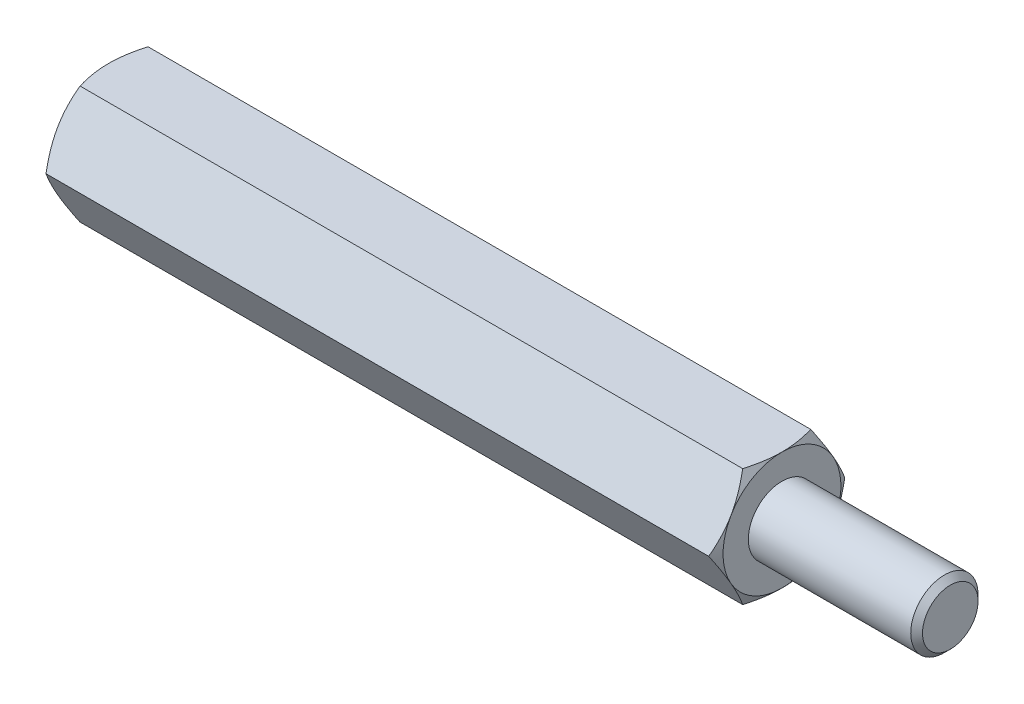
ISO-10303-21;
HEADER;
FILE_DESCRIPTION(('STEP AP214'),'2;1');
FILE_NAME('part.step','',(''),(''),'','','');
FILE_SCHEMA(('AUTOMOTIVE_DESIGN { 1 0 10303 214 1 1 1 1 }'));
ENDSEC;
DATA;
#1=APPLICATION_CONTEXT('core data for automotive mechanical design processes');
#2=APPLICATION_PROTOCOL_DEFINITION('international standard','automotive_design',2000,#1);
#3=PRODUCT_CONTEXT('',#1,'mechanical');
#4=PRODUCT('Part','Part','',(#3));
#5=PRODUCT_RELATED_PRODUCT_CATEGORY('part','',(#4));
#6=PRODUCT_DEFINITION_FORMATION('','',#4);
#7=PRODUCT_DEFINITION_CONTEXT('part definition',#1,'design');
#8=PRODUCT_DEFINITION('design','',#6,#7);
#9=PRODUCT_DEFINITION_SHAPE('','',#8);
#10=(LENGTH_UNIT() NAMED_UNIT(*) SI_UNIT(.MILLI.,.METRE.));
#11=(NAMED_UNIT(*) PLANE_ANGLE_UNIT() SI_UNIT($,.RADIAN.));
#12=(NAMED_UNIT(*) SI_UNIT($,.STERADIAN.) SOLID_ANGLE_UNIT());
#13=UNCERTAINTY_MEASURE_WITH_UNIT(LENGTH_MEASURE(1.E-05),#10,'distance_accuracy_value','');
#14=(GEOMETRIC_REPRESENTATION_CONTEXT(3) GLOBAL_UNCERTAINTY_ASSIGNED_CONTEXT((#13)) GLOBAL_UNIT_ASSIGNED_CONTEXT((#10,
#11,#12)) REPRESENTATION_CONTEXT('',''));
#15=CARTESIAN_POINT('',(0.,0.,0.));
#16=DIRECTION('',(0.,0.,1.));
#17=DIRECTION('',(1.,0.,0.));
#18=AXIS2_PLACEMENT_3D('',#15,#16,#17);
#19=CARTESIAN_POINT('',(20.,3.5,-2.02072594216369));
#20=DIRECTION('',(1.,0.,0.));
#21=DIRECTION('',(0.,0.,-1.));
#22=AXIS2_PLACEMENT_3D('',#19,#20,#21);
#23=PLANE('',#22);
#24=CARTESIAN_POINT('',(20.,0.,0.));
#25=DIRECTION('',(1.,0.,0.));
#26=DIRECTION('',(0.,0.,-1.));
#27=AXIS2_PLACEMENT_3D('',#24,#25,#26);
#28=CIRCLE('',#27,3.5);
#29=CARTESIAN_POINT('',(20.,-1.75,-3.03108891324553));
#30=VERTEX_POINT('',#29);
#31=CARTESIAN_POINT('',(20.,1.75,-3.03108891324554));
#32=VERTEX_POINT('',#31);
#33=EDGE_CURVE('E288',#30,#32,#28,.T.);
#34=ORIENTED_EDGE('',*,*,#33,.T.);
#35=CARTESIAN_POINT('',(20.,3.5,0.));
#36=VERTEX_POINT('',#35);
#37=EDGE_CURVE('E53',#32,#36,#28,.T.);
#38=ORIENTED_EDGE('',*,*,#37,.T.);
#39=CARTESIAN_POINT('',(20.,1.75,3.03108891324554));
#40=VERTEX_POINT('',#39);
#41=EDGE_CURVE('E297',#36,#40,#28,.T.);
#42=ORIENTED_EDGE('',*,*,#41,.T.);
#43=CARTESIAN_POINT('',(20.,-1.75000000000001,3.03108891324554));
#44=VERTEX_POINT('',#43);
#45=EDGE_CURVE('E303',#40,#44,#28,.T.);
#46=ORIENTED_EDGE('',*,*,#45,.T.);
#47=CARTESIAN_POINT('',(20.,0.,0.));
#48=DIRECTION('',(-1.,0.,0.));
#49=DIRECTION('',(0.,-1.,0.));
#50=AXIS2_PLACEMENT_3D('',#47,#48,#49);
#51=CIRCLE('',#50,3.5);
#52=CARTESIAN_POINT('',(20.,-3.50000000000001,0.));
#53=VERTEX_POINT('',#52);
#54=EDGE_CURVE('E193',#53,#44,#51,.T.);
#55=ORIENTED_EDGE('',*,*,#54,.F.);
#56=EDGE_CURVE('E61',#53,#30,#28,.T.);
#57=ORIENTED_EDGE('',*,*,#56,.T.);
#58=EDGE_LOOP('',(#34,#38,#42,#46,#55,#57));
#59=FACE_BOUND('',#58,.T.);
#60=CARTESIAN_POINT('',(20.,0.,0.));
#61=DIRECTION('',(1.,0.,0.));
#62=DIRECTION('',(0.,0.,-1.));
#63=AXIS2_PLACEMENT_3D('',#60,#61,#62);
#64=CIRCLE('',#63,2.);
#65=CARTESIAN_POINT('',(20.,0.,-2.));
#66=VERTEX_POINT('',#65);
#67=EDGE_CURVE('E326',#66,#66,#64,.T.);
#68=ORIENTED_EDGE('',*,*,#67,.F.);
#69=EDGE_LOOP('',(#68));
#70=FACE_BOUND('',#69,.T.);
#71=ADVANCED_FACE('F37',(#59,#70),#23,.T.);
#72=CARTESIAN_POINT('',(20.,0.,-4.04145188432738));
#73=DIRECTION('',(0.,-0.5,0.866025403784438));
#74=DIRECTION('',(0.,-0.866025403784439,-0.5));
#75=AXIS2_PLACEMENT_3D('',#72,#73,#74);
#76=PLANE('',#75);
#77=CARTESIAN_POINT('',(19.6873259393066,-0.000200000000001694,-4.04156735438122));
#78=CARTESIAN_POINT('',(19.73861421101,0.153607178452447,-3.9527667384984));
#79=CARTESIAN_POINT('',(19.7852590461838,0.308742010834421,-3.86319960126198));
#80=CARTESIAN_POINT('',(19.8666781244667,0.621698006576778,-3.68251437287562));
#81=CARTESIAN_POINT('',(19.9014235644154,0.779524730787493,-3.59139307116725));
#82=CARTESIAN_POINT('',(19.9555099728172,1.09322221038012,-3.41027974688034));
#83=CARTESIAN_POINT('',(19.9752109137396,1.24904469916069,-3.32031559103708));
#84=CARTESIAN_POINT('',(19.9987298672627,1.56142288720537,-3.13996396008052));
#85=CARTESIAN_POINT('',(20.0025673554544,1.71797745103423,-3.04957714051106));
#86=CARTESIAN_POINT('',(19.994584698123,2.01050921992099,-2.88068384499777));
#87=CARTESIAN_POINT('',(19.9847245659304,2.1465302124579,-2.80215208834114));
#88=CARTESIAN_POINT('',(19.9534735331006,2.41768602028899,-2.64560020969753));
#89=CARTESIAN_POINT('',(19.9320719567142,2.55281989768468,-2.5675806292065));
#90=CARTESIAN_POINT('',(19.8785695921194,2.82453479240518,-2.41070596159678));
#91=CARTESIAN_POINT('',(19.8462420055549,2.96108141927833,-2.33187072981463));
#92=CARTESIAN_POINT('',(19.772871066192,3.2321380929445,-2.17537608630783));
#93=CARTESIAN_POINT('',(19.7318449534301,3.36665161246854,-2.09771466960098));
#94=CARTESIAN_POINT('',(19.6873259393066,3.5002,-2.02061047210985));
#95=B_SPLINE_CURVE_WITH_KNOTS('',3,(#77,#78,#79,#80,#81,#82,#83,#84,#85,#86,#87,#88,#89,#90,#91,
#92,#93,#94),.UNSPECIFIED.,.F.,.F.,(4,2,2,2,2,2,2,2,4),(0.,0.554793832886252,1.11092123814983,
1.65328467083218,2.19498204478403,2.6666513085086,3.13875761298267,3.6213361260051,
4.10296698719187),.UNSPECIFIED.);
#96=CARTESIAN_POINT('',(19.6873926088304,0.,-4.04145188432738));
#97=VERTEX_POINT('',#96);
#98=EDGE_CURVE('E333',#97,#32,#95,.T.);
#99=ORIENTED_EDGE('',*,*,#98,.F.);
#100=DIRECTION('',(-1.,0.,0.));
#101=VECTOR('',#100,1.);
#102=CARTESIAN_POINT('',(20.,0.,-4.04145188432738));
#103=LINE('',#102,#101);
#104=CARTESIAN_POINT('',(-19.6873926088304,0.,-4.04145188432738));
#105=VERTEX_POINT('',#104);
#106=EDGE_CURVE('E264',#97,#105,#103,.T.);
#107=ORIENTED_EDGE('',*,*,#106,.T.);
#108=CARTESIAN_POINT('',(-19.6873259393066,3.5002,-2.02061047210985));
#109=CARTESIAN_POINT('',(-19.73861421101,3.34639282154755,-2.10941108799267));
#110=CARTESIAN_POINT('',(-19.7852590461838,3.19125798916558,-2.19897822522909));
#111=CARTESIAN_POINT('',(-19.8666781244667,2.87830199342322,-2.37966345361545));
#112=CARTESIAN_POINT('',(-19.9014235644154,2.7204752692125,-2.47078475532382));
#113=CARTESIAN_POINT('',(-19.9555099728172,2.40677778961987,-2.65189807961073));
#114=CARTESIAN_POINT('',(-19.9752109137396,2.25095530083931,-2.74186223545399));
#115=CARTESIAN_POINT('',(-19.9987298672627,1.93857711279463,-2.92221386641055));
#116=CARTESIAN_POINT('',(-20.0025673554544,1.78202254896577,-3.01260068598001));
#117=CARTESIAN_POINT('',(-19.994584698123,1.48949078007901,-3.1814939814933));
#118=CARTESIAN_POINT('',(-19.9847245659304,1.35346978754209,-3.26002573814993));
#119=CARTESIAN_POINT('',(-19.9534735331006,1.08231397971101,-3.41657761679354));
#120=CARTESIAN_POINT('',(-19.9320719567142,0.947180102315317,-3.49459719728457));
#121=CARTESIAN_POINT('',(-19.8785695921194,0.675465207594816,-3.65147186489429));
#122=CARTESIAN_POINT('',(-19.8462420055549,0.538918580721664,-3.73030709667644));
#123=CARTESIAN_POINT('',(-19.772871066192,0.267861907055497,-3.88680174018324));
#124=CARTESIAN_POINT('',(-19.7318449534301,0.133348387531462,-3.96446315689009));
#125=CARTESIAN_POINT('',(-19.6873259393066,-0.000200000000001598,-4.04156735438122));
#126=B_SPLINE_CURVE_WITH_KNOTS('',3,(#108,#109,#110,#111,#112,#113,#114,#115,#116,#117,#118,
#119,#120,#121,#122,#123,#124,#125),.UNSPECIFIED.,.F.,.F.,(4,2,2,2,2,2,2,2,4),(0.,
0.554793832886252,1.11092123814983,1.65328467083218,2.19498204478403,2.6666513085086,
3.13875761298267,3.6213361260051,4.10296698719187),.UNSPECIFIED.);
#127=CARTESIAN_POINT('',(-20.,1.75,-3.03108891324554));
#128=VERTEX_POINT('',#127);
#129=EDGE_CURVE('E314',#128,#105,#126,.T.);
#130=ORIENTED_EDGE('',*,*,#129,.F.);
#131=CARTESIAN_POINT('',(-19.6873926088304,3.5,-2.02072594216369));
#132=VERTEX_POINT('',#131);
#133=EDGE_CURVE('E374',#132,#128,#126,.T.);
#134=ORIENTED_EDGE('',*,*,#133,.F.);
#135=DIRECTION('',(-1.,0.,0.));
#136=VECTOR('',#135,1.);
#137=CARTESIAN_POINT('',(20.,3.5,-2.02072594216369));
#138=LINE('',#137,#136);
#139=CARTESIAN_POINT('',(19.6873926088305,3.5,-2.02072594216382));
#140=VERTEX_POINT('',#139);
#141=EDGE_CURVE('E279',#140,#132,#138,.T.);
#142=ORIENTED_EDGE('',*,*,#141,.F.);
#143=EDGE_CURVE('E229',#32,#140,#95,.T.);
#144=ORIENTED_EDGE('',*,*,#143,.F.);
#145=EDGE_LOOP('',(#99,#107,#130,#134,#142,#144));
#146=FACE_BOUND('',#145,.T.);
#147=ADVANCED_FACE('F148',(#146),#76,.F.);
#148=CARTESIAN_POINT('',(20.,3.5,-2.02072594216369));
#149=DIRECTION('',(0.,-1.,0.));
#150=DIRECTION('',(0.,0.,-1.));
#151=AXIS2_PLACEMENT_3D('',#148,#149,#150);
#152=PLANE('',#151);
#153=CARTESIAN_POINT('',(18.2443294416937,3.5,-5.525713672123));
#154=CARTESIAN_POINT('',(18.3192813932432,3.5,-5.37200190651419));
#155=CARTESIAN_POINT('',(18.3935424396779,3.5,-5.21794762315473));
#156=CARTESIAN_POINT('',(18.5402960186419,3.5,-4.90897223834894));
#157=CARTESIAN_POINT('',(18.6127882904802,3.5,-4.75405101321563));
#158=CARTESIAN_POINT('',(18.7559617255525,3.5,-4.44240758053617));
#159=CARTESIAN_POINT('',(18.8266316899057,3.5,-4.28568021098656));
#160=CARTESIAN_POINT('',(18.9652074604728,3.5,-3.97101270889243));
#161=CARTESIAN_POINT('',(19.0331133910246,3.5,-3.81307263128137));
#162=CARTESIAN_POINT('',(19.1677143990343,3.5,-3.49026114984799));
#163=CARTESIAN_POINT('',(19.2342871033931,3.5,-3.32533845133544));
#164=CARTESIAN_POINT('',(19.3626267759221,3.5,-2.99359992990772));
#165=CARTESIAN_POINT('',(19.4243932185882,3.5,-2.82678390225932));
#166=CARTESIAN_POINT('',(19.5415700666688,3.5,-2.49127529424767));
#167=CARTESIAN_POINT('',(19.5969925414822,3.5,-2.32258697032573));
#168=CARTESIAN_POINT('',(19.6997679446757,3.5,-1.98279215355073));
#169=CARTESIAN_POINT('',(19.7471233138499,3.5,-1.81168640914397));
#170=CARTESIAN_POINT('',(19.8312987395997,3.5,-1.46793354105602));
#171=CARTESIAN_POINT('',(19.8681796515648,3.5,-1.2953015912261));
#172=CARTESIAN_POINT('',(19.9293955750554,3.5,-0.947791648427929));
#173=CARTESIAN_POINT('',(19.953731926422,3.5,-0.772913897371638));
#174=CARTESIAN_POINT('',(19.9876038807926,3.5,-0.424108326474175));
#175=CARTESIAN_POINT('',(19.997337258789,3.5,-0.250200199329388));
#176=CARTESIAN_POINT('',(20.0017053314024,3.5,0.0978233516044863));
#177=CARTESIAN_POINT('',(19.9963399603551,3.5,0.271938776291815));
#178=CARTESIAN_POINT('',(19.9750118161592,3.5,0.564711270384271));
#179=CARTESIAN_POINT('',(19.9628919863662,3.5,0.683667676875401));
#180=CARTESIAN_POINT('',(19.9323080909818,3.5,0.920767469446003));
#181=CARTESIAN_POINT('',(19.9138432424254,3.5,1.03891075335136));
#182=CARTESIAN_POINT('',(19.8498956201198,3.5,1.39193174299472));
#183=CARTESIAN_POINT('',(19.7958695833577,3.5,1.62528232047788));
#184=CARTESIAN_POINT('',(19.7014515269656,3.5,1.97433825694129));
#185=CARTESIAN_POINT('',(19.6672900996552,3.5,2.09183268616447));
#186=CARTESIAN_POINT('',(19.595234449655,3.5,2.32568238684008));
#187=CARTESIAN_POINT('',(19.5573401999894,3.5,2.44203765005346));
#188=CARTESIAN_POINT('',(19.4784421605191,3.5,2.6736423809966));
#189=CARTESIAN_POINT('',(19.4374392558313,3.5,2.78889215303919));
#190=CARTESIAN_POINT('',(19.352824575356,3.5,3.01842460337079));
#191=CARTESIAN_POINT('',(19.3092128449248,3.5,3.1327072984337));
#192=CARTESIAN_POINT('',(19.1958241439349,3.5,3.42150510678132));
#193=CARTESIAN_POINT('',(19.1245636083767,3.5,3.59543696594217));
#194=CARTESIAN_POINT('',(18.9781026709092,3.5,3.94163961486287));
#195=CARTESIAN_POINT('',(18.9029019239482,3.5,4.11391025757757));
#196=CARTESIAN_POINT('',(18.7494252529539,3.5,4.45713072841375));
#197=CARTESIAN_POINT('',(18.6711484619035,3.5,4.62808016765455));
#198=CARTESIAN_POINT('',(18.512188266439,3.5,4.9688584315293));
#199=CARTESIAN_POINT('',(18.4315047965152,3.5,5.13868722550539));
#200=CARTESIAN_POINT('',(18.1863871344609,3.5,5.64726192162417));
#201=CARTESIAN_POINT('',(18.0190975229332,3.5,5.98463020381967));
#202=CARTESIAN_POINT('',(17.6795854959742,3.5,6.65678495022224));
#203=CARTESIAN_POINT('',(17.5073639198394,3.5,6.99157184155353));
#204=CARTESIAN_POINT('',(17.1760800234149,3.5,7.62749570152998));
#205=CARTESIAN_POINT('',(17.0173299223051,3.5,7.92879562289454));
#206=CARTESIAN_POINT('',(16.6977473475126,3.5,8.53030635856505));
#207=CARTESIAN_POINT('',(16.5369147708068,3.5,8.83051711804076));
#208=CARTESIAN_POINT('',(16.2141792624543,3.5,9.42918006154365));
#209=CARTESIAN_POINT('',(16.0522810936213,3.5,9.72763481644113));
#210=CARTESIAN_POINT('',(15.7272737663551,3.5,10.3238577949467));
#211=CARTESIAN_POINT('',(15.5641646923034,3.5,10.6216260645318));
#212=CARTESIAN_POINT('',(15.4006104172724,3.5,10.9191478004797));
#213=B_SPLINE_CURVE_WITH_KNOTS('',3,(#153,#154,#155,#156,#157,#158,#159,#160,#161,#162,#163,
#164,#165,#166,#167,#168,#169,#170,#171,#172,#173,#174,#175,#176,#177,#178,#179,#180,#181,#182,
#183,#184,#185,#186,#187,#188,#189,#190,#191,#192,#193,#194,#195,#196,#197,#198,#199,#200,#201,
#202,#203,#204,#205,#206,#207,#208,#209,#210,#211,#212),.UNSPECIFIED.,.F.,.F.,(4,2,2,2,2,2,2,2,
2,2,2,2,2,2,2,2,2,2,2,2,2,2,2,2,2,2,2,2,2,4),(0.,0.513041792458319,1.02615874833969,
1.54190801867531,2.05763406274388,2.59113284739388,3.1246898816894,3.65721433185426,
4.18957737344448,4.71878103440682,5.24792816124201,5.76984197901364,6.29175806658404,
6.6503025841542,7.00889136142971,7.72642330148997,8.0934692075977,8.46051776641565,
8.82746220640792,9.19440026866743,9.75822236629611,10.3220939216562,10.8861255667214,
11.4501725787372,12.579801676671,13.7092396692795,14.730918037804,15.7526471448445,
16.771258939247,17.7898004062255),.UNSPECIFIED.);
#214=EDGE_CURVE('E227',#140,#36,#213,.T.);
#215=ORIENTED_EDGE('',*,*,#214,.F.);
#216=ORIENTED_EDGE('',*,*,#141,.T.);
#217=CARTESIAN_POINT('',(-18.2443294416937,3.5,-5.525713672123));
#218=CARTESIAN_POINT('',(-18.3192813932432,3.5,-5.37200190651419));
#219=CARTESIAN_POINT('',(-18.3935424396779,3.5,-5.21794762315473));
#220=CARTESIAN_POINT('',(-18.5402960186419,3.5,-4.90897223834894));
#221=CARTESIAN_POINT('',(-18.6127882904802,3.5,-4.75405101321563));
#222=CARTESIAN_POINT('',(-18.7559617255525,3.5,-4.44240758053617));
#223=CARTESIAN_POINT('',(-18.8266316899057,3.5,-4.28568021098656));
#224=CARTESIAN_POINT('',(-18.9652074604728,3.5,-3.97101270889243));
#225=CARTESIAN_POINT('',(-19.0331133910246,3.5,-3.81307263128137));
#226=CARTESIAN_POINT('',(-19.1677143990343,3.5,-3.49026114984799));
#227=CARTESIAN_POINT('',(-19.2342871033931,3.5,-3.32533845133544));
#228=CARTESIAN_POINT('',(-19.3626267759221,3.5,-2.99359992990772));
#229=CARTESIAN_POINT('',(-19.4243932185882,3.5,-2.82678390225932));
#230=CARTESIAN_POINT('',(-19.5415700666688,3.5,-2.49127529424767));
#231=CARTESIAN_POINT('',(-19.5969925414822,3.5,-2.32258697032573));
#232=CARTESIAN_POINT('',(-19.6997679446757,3.5,-1.98279215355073));
#233=CARTESIAN_POINT('',(-19.7471233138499,3.5,-1.81168640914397));
#234=CARTESIAN_POINT('',(-19.8312987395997,3.5,-1.46793354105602));
#235=CARTESIAN_POINT('',(-19.8681796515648,3.5,-1.2953015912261));
#236=CARTESIAN_POINT('',(-19.9293955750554,3.5,-0.947791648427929));
#237=CARTESIAN_POINT('',(-19.953731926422,3.5,-0.772913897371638));
#238=CARTESIAN_POINT('',(-19.9876038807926,3.5,-0.424108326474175));
#239=CARTESIAN_POINT('',(-19.997337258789,3.5,-0.250200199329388));
#240=CARTESIAN_POINT('',(-20.0017053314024,3.5,0.0978233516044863));
#241=CARTESIAN_POINT('',(-19.9963399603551,3.5,0.271938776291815));
#242=CARTESIAN_POINT('',(-19.9750118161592,3.5,0.564711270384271));
#243=CARTESIAN_POINT('',(-19.9628919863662,3.5,0.683667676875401));
#244=CARTESIAN_POINT('',(-19.9323080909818,3.5,0.920767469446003));
#245=CARTESIAN_POINT('',(-19.9138432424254,3.5,1.03891075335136));
#246=CARTESIAN_POINT('',(-19.8498956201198,3.5,1.39193174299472));
#247=CARTESIAN_POINT('',(-19.7958695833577,3.5,1.62528232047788));
#248=CARTESIAN_POINT('',(-19.7014515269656,3.5,1.97433825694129));
#249=CARTESIAN_POINT('',(-19.6672900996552,3.5,2.09183268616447));
#250=CARTESIAN_POINT('',(-19.595234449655,3.5,2.32568238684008));
#251=CARTESIAN_POINT('',(-19.5573401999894,3.5,2.44203765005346));
#252=CARTESIAN_POINT('',(-19.4784421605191,3.5,2.6736423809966));
#253=CARTESIAN_POINT('',(-19.4374392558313,3.5,2.78889215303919));
#254=CARTESIAN_POINT('',(-19.352824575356,3.5,3.01842460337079));
#255=CARTESIAN_POINT('',(-19.3092128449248,3.5,3.1327072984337));
#256=CARTESIAN_POINT('',(-19.1958241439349,3.5,3.42150510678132));
#257=CARTESIAN_POINT('',(-19.1245636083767,3.5,3.59543696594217));
#258=CARTESIAN_POINT('',(-18.9781026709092,3.5,3.94163961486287));
#259=CARTESIAN_POINT('',(-18.9029019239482,3.5,4.11391025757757));
#260=CARTESIAN_POINT('',(-18.7494252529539,3.5,4.45713072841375));
#261=CARTESIAN_POINT('',(-18.6711484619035,3.5,4.62808016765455));
#262=CARTESIAN_POINT('',(-18.512188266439,3.5,4.9688584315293));
#263=CARTESIAN_POINT('',(-18.4315047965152,3.5,5.13868722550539));
#264=CARTESIAN_POINT('',(-18.1863871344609,3.5,5.64726192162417));
#265=CARTESIAN_POINT('',(-18.0190975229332,3.5,5.98463020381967));
#266=CARTESIAN_POINT('',(-17.6795854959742,3.5,6.65678495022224));
#267=CARTESIAN_POINT('',(-17.5073639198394,3.5,6.99157184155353));
#268=CARTESIAN_POINT('',(-17.1760800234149,3.5,7.62749570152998));
#269=CARTESIAN_POINT('',(-17.0173299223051,3.5,7.92879562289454));
#270=CARTESIAN_POINT('',(-16.6977473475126,3.5,8.53030635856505));
#271=CARTESIAN_POINT('',(-16.5369147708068,3.5,8.83051711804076));
#272=CARTESIAN_POINT('',(-16.2141792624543,3.5,9.42918006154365));
#273=CARTESIAN_POINT('',(-16.0522810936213,3.5,9.72763481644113));
#274=CARTESIAN_POINT('',(-15.7272737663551,3.5,10.3238577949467));
#275=CARTESIAN_POINT('',(-15.5641646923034,3.5,10.6216260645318));
#276=CARTESIAN_POINT('',(-15.4006104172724,3.5,10.9191478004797));
#277=B_SPLINE_CURVE_WITH_KNOTS('',3,(#217,#218,#219,#220,#221,#222,#223,#224,#225,#226,#227,
#228,#229,#230,#231,#232,#233,#234,#235,#236,#237,#238,#239,#240,#241,#242,#243,#244,#245,#246,
#247,#248,#249,#250,#251,#252,#253,#254,#255,#256,#257,#258,#259,#260,#261,#262,#263,#264,#265,
#266,#267,#268,#269,#270,#271,#272,#273,#274,#275,#276),.UNSPECIFIED.,.F.,.F.,(4,2,2,2,2,2,2,2,
2,2,2,2,2,2,2,2,2,2,2,2,2,2,2,2,2,2,2,2,2,4),(0.,0.513041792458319,1.02615874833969,
1.54190801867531,2.05763406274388,2.59113284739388,3.1246898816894,3.65721433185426,
4.18957737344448,4.71878103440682,5.24792816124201,5.76984197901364,6.29175806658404,
6.6503025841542,7.00889136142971,7.72642330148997,8.0934692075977,8.46051776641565,
8.82746220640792,9.19440026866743,9.75822236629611,10.3220939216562,10.8861255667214,
11.4501725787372,12.579801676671,13.7092396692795,14.730918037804,15.7526471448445,
16.771258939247,17.7898004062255),.UNSPECIFIED.);
#278=CARTESIAN_POINT('',(-20.,3.5,0.));
#279=VERTEX_POINT('',#278);
#280=EDGE_CURVE('E241',#279,#132,#277,.F.);
#281=ORIENTED_EDGE('',*,*,#280,.F.);
#282=CARTESIAN_POINT('',(-19.6873926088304,3.5,2.02072594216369));
#283=VERTEX_POINT('',#282);
#284=EDGE_CURVE('E249',#283,#279,#277,.F.);
#285=ORIENTED_EDGE('',*,*,#284,.F.);
#286=DIRECTION('',(-1.,0.,0.));
#287=VECTOR('',#286,1.);
#288=CARTESIAN_POINT('',(20.,3.5,2.02072594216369));
#289=LINE('',#288,#287);
#290=CARTESIAN_POINT('',(19.6873926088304,3.5,2.02072594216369));
#291=VERTEX_POINT('',#290);
#292=EDGE_CURVE('E276',#291,#283,#289,.T.);
#293=ORIENTED_EDGE('',*,*,#292,.F.);
#294=EDGE_CURVE('E221',#36,#291,#213,.T.);
#295=ORIENTED_EDGE('',*,*,#294,.F.);
#296=EDGE_LOOP('',(#215,#216,#281,#285,#293,#295));
#297=FACE_BOUND('',#296,.T.);
#298=ADVANCED_FACE('F153',(#297),#152,.F.);
#299=CARTESIAN_POINT('',(20.,3.5,2.02072594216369));
#300=DIRECTION('',(0.,-0.5,-0.866025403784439));
#301=DIRECTION('',(0.,0.866025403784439,-0.5));
#302=AXIS2_PLACEMENT_3D('',#299,#300,#301);
#303=PLANE('',#302);
#304=CARTESIAN_POINT('',(19.6873259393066,3.5002,2.02061047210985));
#305=CARTESIAN_POINT('',(19.73861421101,3.34639282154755,2.10941108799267));
#306=CARTESIAN_POINT('',(19.7852590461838,3.19125798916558,2.19897822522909));
#307=CARTESIAN_POINT('',(19.8666781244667,2.87830199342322,2.37966345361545));
#308=CARTESIAN_POINT('',(19.9014235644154,2.7204752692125,2.47078475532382));
#309=CARTESIAN_POINT('',(19.9555099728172,2.40677778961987,2.65189807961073));
#310=CARTESIAN_POINT('',(19.9752109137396,2.25095530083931,2.74186223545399));
#311=CARTESIAN_POINT('',(19.9987298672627,1.93857711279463,2.92221386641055));
#312=CARTESIAN_POINT('',(20.0025673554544,1.78202254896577,3.01260068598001));
#313=CARTESIAN_POINT('',(19.994584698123,1.48949078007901,3.1814939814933));
#314=CARTESIAN_POINT('',(19.9847245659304,1.35346978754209,3.26002573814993));
#315=CARTESIAN_POINT('',(19.9534735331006,1.08231397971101,3.41657761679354));
#316=CARTESIAN_POINT('',(19.9320719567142,0.947180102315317,3.49459719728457));
#317=CARTESIAN_POINT('',(19.8785695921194,0.675465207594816,3.65147186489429));
#318=CARTESIAN_POINT('',(19.8462420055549,0.538918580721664,3.73030709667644));
#319=CARTESIAN_POINT('',(19.772871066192,0.267861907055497,3.88680174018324));
#320=CARTESIAN_POINT('',(19.7318449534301,0.133348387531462,3.96446315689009));
#321=CARTESIAN_POINT('',(19.6873259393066,-0.000200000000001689,4.04156735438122));
#322=B_SPLINE_CURVE_WITH_KNOTS('',3,(#304,#305,#306,#307,#308,#309,#310,#311,#312,#313,#314,
#315,#316,#317,#318,#319,#320,#321),.UNSPECIFIED.,.F.,.F.,(4,2,2,2,2,2,2,2,4),(0.,
0.554793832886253,1.11092123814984,1.65328467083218,2.19498204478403,2.6666513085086,
3.13875761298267,3.6213361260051,4.10296698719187),.UNSPECIFIED.);
#323=EDGE_CURVE('E228',#291,#40,#322,.T.);
#324=ORIENTED_EDGE('',*,*,#323,.F.);
#325=ORIENTED_EDGE('',*,*,#292,.T.);
#326=CARTESIAN_POINT('',(-19.6873259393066,-0.000200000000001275,4.04156735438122));
#327=CARTESIAN_POINT('',(-19.73861421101,0.153607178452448,3.9527667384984));
#328=CARTESIAN_POINT('',(-19.7852590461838,0.308742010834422,3.86319960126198));
#329=CARTESIAN_POINT('',(-19.8666781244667,0.621698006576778,3.68251437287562));
#330=CARTESIAN_POINT('',(-19.9014235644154,0.779524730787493,3.59139307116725));
#331=CARTESIAN_POINT('',(-19.9555099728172,1.09322221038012,3.41027974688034));
#332=CARTESIAN_POINT('',(-19.9752109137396,1.24904469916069,3.32031559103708));
#333=CARTESIAN_POINT('',(-19.9987298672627,1.56142288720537,3.13996396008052));
#334=CARTESIAN_POINT('',(-20.0025673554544,1.71797745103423,3.04957714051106));
#335=CARTESIAN_POINT('',(-19.994584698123,2.01050921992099,2.88068384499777));
#336=CARTESIAN_POINT('',(-19.9847245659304,2.1465302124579,2.80215208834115));
#337=CARTESIAN_POINT('',(-19.9534735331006,2.41768602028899,2.64560020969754));
#338=CARTESIAN_POINT('',(-19.9320719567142,2.55281989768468,2.5675806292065));
#339=CARTESIAN_POINT('',(-19.8785695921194,2.82453479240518,2.41070596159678));
#340=CARTESIAN_POINT('',(-19.8462420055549,2.96108141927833,2.33187072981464));
#341=CARTESIAN_POINT('',(-19.772871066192,3.2321380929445,2.17537608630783));
#342=CARTESIAN_POINT('',(-19.7318449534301,3.36665161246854,2.09771466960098));
#343=CARTESIAN_POINT('',(-19.6873259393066,3.5002,2.02061047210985));
#344=B_SPLINE_CURVE_WITH_KNOTS('',3,(#326,#327,#328,#329,#330,#331,#332,#333,#334,#335,#336,
#337,#338,#339,#340,#341,#342,#343),.UNSPECIFIED.,.F.,.F.,(4,2,2,2,2,2,2,2,4),(0.,
0.554793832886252,1.11092123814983,1.65328467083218,2.19498204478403,2.6666513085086,
3.13875761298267,3.62133612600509,4.10296698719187),.UNSPECIFIED.);
#345=CARTESIAN_POINT('',(-20.,1.75,3.03108891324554));
#346=VERTEX_POINT('',#345);
#347=EDGE_CURVE('E255',#346,#283,#344,.T.);
#348=ORIENTED_EDGE('',*,*,#347,.F.);
#349=CARTESIAN_POINT('',(-19.6873926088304,0.,4.04145188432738));
#350=VERTEX_POINT('',#349);
#351=EDGE_CURVE('E262',#350,#346,#344,.T.);
#352=ORIENTED_EDGE('',*,*,#351,.F.);
#353=DIRECTION('',(-1.,0.,0.));
#354=VECTOR('',#353,1.);
#355=CARTESIAN_POINT('',(20.,0.,4.04145188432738));
#356=LINE('',#355,#354);
#357=CARTESIAN_POINT('',(19.6873926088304,0.,4.04145188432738));
#358=VERTEX_POINT('',#357);
#359=EDGE_CURVE('E273',#358,#350,#356,.T.);
#360=ORIENTED_EDGE('',*,*,#359,.F.);
#361=EDGE_CURVE('E215',#40,#358,#322,.T.);
#362=ORIENTED_EDGE('',*,*,#361,.F.);
#363=EDGE_LOOP('',(#324,#325,#348,#352,#360,#362));
#364=FACE_BOUND('',#363,.T.);
#365=ADVANCED_FACE('F235',(#364),#303,.F.);
#366=CARTESIAN_POINT('',(20.,0.,4.04145188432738));
#367=DIRECTION('',(0.,0.5,-0.866025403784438));
#368=DIRECTION('',(0.,0.866025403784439,0.5));
#369=AXIS2_PLACEMENT_3D('',#366,#367,#368);
#370=PLANE('',#369);
#371=CARTESIAN_POINT('',(19.6873259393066,0.000199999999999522,4.04156735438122));
#372=CARTESIAN_POINT('',(19.73861421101,-0.15360717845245,3.9527667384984));
#373=CARTESIAN_POINT('',(19.7852590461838,-0.308742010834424,3.86319960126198));
#374=CARTESIAN_POINT('',(19.8666781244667,-0.621698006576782,3.68251437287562));
#375=CARTESIAN_POINT('',(19.9014235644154,-0.779524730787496,3.59139307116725));
#376=CARTESIAN_POINT('',(19.9555099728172,-1.09322221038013,3.41027974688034));
#377=CARTESIAN_POINT('',(19.9752109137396,-1.24904469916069,3.32031559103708));
#378=CARTESIAN_POINT('',(19.9987298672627,-1.56142288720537,3.13996396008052));
#379=CARTESIAN_POINT('',(20.0025673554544,-1.71797745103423,3.04957714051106));
#380=CARTESIAN_POINT('',(19.994584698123,-2.01050921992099,2.88068384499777));
#381=CARTESIAN_POINT('',(19.9847245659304,-2.14653021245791,2.80215208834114));
#382=CARTESIAN_POINT('',(19.9534735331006,-2.41768602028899,2.64560020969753));
#383=CARTESIAN_POINT('',(19.9320719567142,-2.55281989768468,2.5675806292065));
#384=CARTESIAN_POINT('',(19.8785695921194,-2.82453479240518,2.41070596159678));
#385=CARTESIAN_POINT('',(19.8462420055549,-2.96108141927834,2.33187072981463));
#386=CARTESIAN_POINT('',(19.772871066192,-3.2321380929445,2.17537608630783));
#387=CARTESIAN_POINT('',(19.7318449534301,-3.36665161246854,2.09771466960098));
#388=CARTESIAN_POINT('',(19.6873259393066,-3.5002,2.02061047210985));
#389=B_SPLINE_CURVE_WITH_KNOTS('',3,(#371,#372,#373,#374,#375,#376,#377,#378,#379,#380,#381,
#382,#383,#384,#385,#386,#387,#388),.UNSPECIFIED.,.F.,.F.,(4,2,2,2,2,2,2,2,4),(0.,
0.554793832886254,1.11092123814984,1.65328467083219,2.19498204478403,2.6666513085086,
3.13875761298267,3.6213361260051,4.10296698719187),.UNSPECIFIED.);
#390=EDGE_CURVE('E353',#358,#44,#389,.T.);
#391=ORIENTED_EDGE('',*,*,#390,.F.);
#392=ORIENTED_EDGE('',*,*,#359,.T.);
#393=CARTESIAN_POINT('',(-19.6873259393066,-3.5002,2.02061047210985));
#394=CARTESIAN_POINT('',(-19.73861421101,-3.34639282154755,2.10941108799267));
#395=CARTESIAN_POINT('',(-19.7852590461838,-3.19125798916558,2.19897822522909));
#396=CARTESIAN_POINT('',(-19.8666781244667,-2.87830199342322,2.37966345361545));
#397=CARTESIAN_POINT('',(-19.9014235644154,-2.72047526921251,2.47078475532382));
#398=CARTESIAN_POINT('',(-19.9555099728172,-2.40677778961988,2.65189807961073));
#399=CARTESIAN_POINT('',(-19.9752109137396,-2.25095530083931,2.74186223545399));
#400=CARTESIAN_POINT('',(-19.9987298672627,-1.93857711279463,2.92221386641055));
#401=CARTESIAN_POINT('',(-20.0025673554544,-1.78202254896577,3.01260068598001));
#402=CARTESIAN_POINT('',(-19.994584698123,-1.48949078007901,3.1814939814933));
#403=CARTESIAN_POINT('',(-19.9847245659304,-1.3534697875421,3.26002573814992));
#404=CARTESIAN_POINT('',(-19.9534735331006,-1.08231397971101,3.41657761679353));
#405=CARTESIAN_POINT('',(-19.9320719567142,-0.94718010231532,3.49459719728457));
#406=CARTESIAN_POINT('',(-19.8785695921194,-0.675465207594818,3.65147186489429));
#407=CARTESIAN_POINT('',(-19.8462420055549,-0.538918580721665,3.73030709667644));
#408=CARTESIAN_POINT('',(-19.772871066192,-0.267861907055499,3.88680174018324));
#409=CARTESIAN_POINT('',(-19.7318449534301,-0.133348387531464,3.96446315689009));
#410=CARTESIAN_POINT('',(-19.6873259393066,0.000199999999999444,4.04156735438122));
#411=B_SPLINE_CURVE_WITH_KNOTS('',3,(#393,#394,#395,#396,#397,#398,#399,#400,#401,#402,#403,
#404,#405,#406,#407,#408,#409,#410),.UNSPECIFIED.,.F.,.F.,(4,2,2,2,2,2,2,2,4),(0.,
0.554793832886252,1.11092123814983,1.65328467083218,2.19498204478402,2.66665130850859,
3.13875761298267,3.62133612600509,4.10296698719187),.UNSPECIFIED.);
#412=CARTESIAN_POINT('',(-20.,-1.75000000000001,3.03108891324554));
#413=VERTEX_POINT('',#412);
#414=EDGE_CURVE('E263',#413,#350,#411,.T.);
#415=ORIENTED_EDGE('',*,*,#414,.F.);
#416=CARTESIAN_POINT('',(-19.6873926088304,-3.5,2.02072594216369));
#417=VERTEX_POINT('',#416);
#418=EDGE_CURVE('E250',#417,#413,#411,.T.);
#419=ORIENTED_EDGE('',*,*,#418,.F.);
#420=DIRECTION('',(-1.,0.,0.));
#421=VECTOR('',#420,1.);
#422=CARTESIAN_POINT('',(20.,-3.5,2.02072594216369));
#423=LINE('',#422,#421);
#424=CARTESIAN_POINT('',(19.6873926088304,-3.5,2.02072594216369));
#425=VERTEX_POINT('',#424);
#426=EDGE_CURVE('E270',#425,#417,#423,.T.);
#427=ORIENTED_EDGE('',*,*,#426,.F.);
#428=EDGE_CURVE('E210',#44,#425,#389,.T.);
#429=ORIENTED_EDGE('',*,*,#428,.F.);
#430=EDGE_LOOP('',(#391,#392,#415,#419,#427,#429));
#431=FACE_BOUND('',#430,.T.);
#432=ADVANCED_FACE('F445',(#431),#370,.F.);
#433=CARTESIAN_POINT('',(20.,-3.5,2.02072594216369));
#434=DIRECTION('',(0.,1.,0.));
#435=DIRECTION('',(0.,0.,1.));
#436=AXIS2_PLACEMENT_3D('',#433,#434,#435);
#437=PLANE('',#436);
#438=CARTESIAN_POINT('',(18.2443294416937,-3.5,-5.52571367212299));
#439=CARTESIAN_POINT('',(18.3192813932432,-3.5,-5.37200190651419));
#440=CARTESIAN_POINT('',(18.3935424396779,-3.5,-5.21794762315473));
#441=CARTESIAN_POINT('',(18.5402960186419,-3.5,-4.90897223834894));
#442=CARTESIAN_POINT('',(18.6127882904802,-3.5,-4.75405101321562));
#443=CARTESIAN_POINT('',(18.7559617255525,-3.5,-4.44240758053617));
#444=CARTESIAN_POINT('',(18.8266316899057,-3.5,-4.28568021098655));
#445=CARTESIAN_POINT('',(18.9652074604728,-3.5,-3.97101270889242));
#446=CARTESIAN_POINT('',(19.0331133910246,-3.5,-3.81307263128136));
#447=CARTESIAN_POINT('',(19.1677143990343,-3.5,-3.49026114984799));
#448=CARTESIAN_POINT('',(19.2342871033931,-3.5,-3.32533845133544));
#449=CARTESIAN_POINT('',(19.3626267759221,-3.5,-2.99359992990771));
#450=CARTESIAN_POINT('',(19.4243932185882,-3.5,-2.82678390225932));
#451=CARTESIAN_POINT('',(19.5415700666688,-3.5,-2.49127529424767));
#452=CARTESIAN_POINT('',(19.5969925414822,-3.5,-2.32258697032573));
#453=CARTESIAN_POINT('',(19.6997679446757,-3.5,-1.98279215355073));
#454=CARTESIAN_POINT('',(19.7471233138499,-3.5,-1.81168640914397));
#455=CARTESIAN_POINT('',(19.8312987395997,-3.5,-1.46793354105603));
#456=CARTESIAN_POINT('',(19.8681796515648,-3.5,-1.2953015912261));
#457=CARTESIAN_POINT('',(19.9293955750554,-3.5,-0.947791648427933));
#458=CARTESIAN_POINT('',(19.953731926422,-3.5,-0.772913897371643));
#459=CARTESIAN_POINT('',(19.9876038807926,-3.5,-0.424108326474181));
#460=CARTESIAN_POINT('',(19.997337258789,-3.5,-0.250200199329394));
#461=CARTESIAN_POINT('',(20.0017053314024,-3.5,0.0978233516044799));
#462=CARTESIAN_POINT('',(19.9963399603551,-3.5,0.271938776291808));
#463=CARTESIAN_POINT('',(19.9750118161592,-3.5,0.564711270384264));
#464=CARTESIAN_POINT('',(19.9628919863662,-3.5,0.683667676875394));
#465=CARTESIAN_POINT('',(19.9323080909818,-3.5,0.920767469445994));
#466=CARTESIAN_POINT('',(19.9138432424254,-3.5,1.03891075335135));
#467=CARTESIAN_POINT('',(19.8498956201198,-3.5,1.39193174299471));
#468=CARTESIAN_POINT('',(19.7958695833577,-3.5,1.62528232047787));
#469=CARTESIAN_POINT('',(19.7014515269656,-3.5,1.97433825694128));
#470=CARTESIAN_POINT('',(19.6672900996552,-3.5,2.09183268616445));
#471=CARTESIAN_POINT('',(19.595234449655,-3.5,2.32568238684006));
#472=CARTESIAN_POINT('',(19.5573401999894,-3.5,2.44203765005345));
#473=CARTESIAN_POINT('',(19.4784421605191,-3.5,2.67364238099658));
#474=CARTESIAN_POINT('',(19.4374392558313,-3.5,2.78889215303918));
#475=CARTESIAN_POINT('',(19.352824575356,-3.5,3.01842460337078));
#476=CARTESIAN_POINT('',(19.3092128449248,-3.5,3.13270729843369));
#477=CARTESIAN_POINT('',(19.1958241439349,-3.5,3.42150510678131));
#478=CARTESIAN_POINT('',(19.1245636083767,-3.5,3.59543696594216));
#479=CARTESIAN_POINT('',(18.9781026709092,-3.5,3.94163961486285));
#480=CARTESIAN_POINT('',(18.9029019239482,-3.5,4.11391025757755));
#481=CARTESIAN_POINT('',(18.7494252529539,-3.5,4.45713072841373));
#482=CARTESIAN_POINT('',(18.6711484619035,-3.5,4.62808016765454));
#483=CARTESIAN_POINT('',(18.5121882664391,-3.5,4.96885843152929));
#484=CARTESIAN_POINT('',(18.4315047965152,-3.5,5.13868722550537));
#485=CARTESIAN_POINT('',(18.1863871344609,-3.5,5.64726192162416));
#486=CARTESIAN_POINT('',(18.0190975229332,-3.5,5.98463020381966));
#487=CARTESIAN_POINT('',(17.6795854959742,-3.5,6.65678495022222));
#488=CARTESIAN_POINT('',(17.5073639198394,-3.5,6.99157184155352));
#489=CARTESIAN_POINT('',(17.1760800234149,-3.5,7.62749570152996));
#490=CARTESIAN_POINT('',(17.0173299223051,-3.5,7.92879562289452));
#491=CARTESIAN_POINT('',(16.6977473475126,-3.5,8.53030635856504));
#492=CARTESIAN_POINT('',(16.5369147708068,-3.5,8.83051711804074));
#493=CARTESIAN_POINT('',(16.2141792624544,-3.5,9.42918006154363));
#494=CARTESIAN_POINT('',(16.0522810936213,-3.5,9.72763481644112));
#495=CARTESIAN_POINT('',(15.7272737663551,-3.5,10.3238577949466));
#496=CARTESIAN_POINT('',(15.5641646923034,-3.5,10.6216260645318));
#497=CARTESIAN_POINT('',(15.4006104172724,-3.5,10.9191478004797));
#498=B_SPLINE_CURVE_WITH_KNOTS('',3,(#438,#439,#440,#441,#442,#443,#444,#445,#446,#447,#448,
#449,#450,#451,#452,#453,#454,#455,#456,#457,#458,#459,#460,#461,#462,#463,#464,#465,#466,#467,
#468,#469,#470,#471,#472,#473,#474,#475,#476,#477,#478,#479,#480,#481,#482,#483,#484,#485,#486,
#487,#488,#489,#490,#491,#492,#493,#494,#495,#496,#497),.UNSPECIFIED.,.F.,.F.,(4,2,2,2,2,2,2,2,
2,2,2,2,2,2,2,2,2,2,2,2,2,2,2,2,2,2,2,2,2,4),(0.,0.513041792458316,1.02615874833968,
1.5419080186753,2.05763406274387,2.59113284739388,3.1246898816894,3.65721433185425,
4.18957737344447,4.71878103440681,5.247928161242,5.76984197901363,6.29175806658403,
6.65030258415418,7.0088913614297,7.72642330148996,8.09346920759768,8.46051776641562,
8.8274622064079,9.1944002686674,9.75822236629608,10.3220939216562,10.8861255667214,
11.4501725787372,12.579801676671,13.7092396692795,14.730918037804,15.7526471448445,
16.7712589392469,17.7898004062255),.UNSPECIFIED.);
#499=EDGE_CURVE('E358',#425,#53,#498,.F.);
#500=ORIENTED_EDGE('',*,*,#499,.F.);
#501=ORIENTED_EDGE('',*,*,#426,.T.);
#502=CARTESIAN_POINT('',(-18.2443294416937,-3.5,-5.52571367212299));
#503=CARTESIAN_POINT('',(-18.3192813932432,-3.5,-5.37200190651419));
#504=CARTESIAN_POINT('',(-18.3935424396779,-3.5,-5.21794762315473));
#505=CARTESIAN_POINT('',(-18.5402960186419,-3.5,-4.90897223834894));
#506=CARTESIAN_POINT('',(-18.6127882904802,-3.5,-4.75405101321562));
#507=CARTESIAN_POINT('',(-18.7559617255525,-3.5,-4.44240758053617));
#508=CARTESIAN_POINT('',(-18.8266316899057,-3.5,-4.28568021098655));
#509=CARTESIAN_POINT('',(-18.9652074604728,-3.5,-3.97101270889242));
#510=CARTESIAN_POINT('',(-19.0331133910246,-3.5,-3.81307263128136));
#511=CARTESIAN_POINT('',(-19.1677143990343,-3.5,-3.49026114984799));
#512=CARTESIAN_POINT('',(-19.2342871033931,-3.5,-3.32533845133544));
#513=CARTESIAN_POINT('',(-19.3626267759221,-3.5,-2.99359992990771));
#514=CARTESIAN_POINT('',(-19.4243932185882,-3.5,-2.82678390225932));
#515=CARTESIAN_POINT('',(-19.5415700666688,-3.5,-2.49127529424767));
#516=CARTESIAN_POINT('',(-19.5969925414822,-3.5,-2.32258697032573));
#517=CARTESIAN_POINT('',(-19.6997679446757,-3.5,-1.98279215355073));
#518=CARTESIAN_POINT('',(-19.7471233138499,-3.5,-1.81168640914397));
#519=CARTESIAN_POINT('',(-19.8312987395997,-3.5,-1.46793354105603));
#520=CARTESIAN_POINT('',(-19.8681796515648,-3.5,-1.2953015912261));
#521=CARTESIAN_POINT('',(-19.9293955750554,-3.5,-0.947791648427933));
#522=CARTESIAN_POINT('',(-19.953731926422,-3.5,-0.772913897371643));
#523=CARTESIAN_POINT('',(-19.9876038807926,-3.5,-0.424108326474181));
#524=CARTESIAN_POINT('',(-19.997337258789,-3.5,-0.250200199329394));
#525=CARTESIAN_POINT('',(-20.0017053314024,-3.5,0.0978233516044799));
#526=CARTESIAN_POINT('',(-19.9963399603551,-3.5,0.271938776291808));
#527=CARTESIAN_POINT('',(-19.9750118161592,-3.5,0.564711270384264));
#528=CARTESIAN_POINT('',(-19.9628919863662,-3.5,0.683667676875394));
#529=CARTESIAN_POINT('',(-19.9323080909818,-3.5,0.920767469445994));
#530=CARTESIAN_POINT('',(-19.9138432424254,-3.5,1.03891075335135));
#531=CARTESIAN_POINT('',(-19.8498956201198,-3.5,1.39193174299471));
#532=CARTESIAN_POINT('',(-19.7958695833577,-3.5,1.62528232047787));
#533=CARTESIAN_POINT('',(-19.7014515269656,-3.5,1.97433825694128));
#534=CARTESIAN_POINT('',(-19.6672900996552,-3.5,2.09183268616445));
#535=CARTESIAN_POINT('',(-19.595234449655,-3.5,2.32568238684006));
#536=CARTESIAN_POINT('',(-19.5573401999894,-3.5,2.44203765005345));
#537=CARTESIAN_POINT('',(-19.4784421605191,-3.5,2.67364238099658));
#538=CARTESIAN_POINT('',(-19.4374392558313,-3.5,2.78889215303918));
#539=CARTESIAN_POINT('',(-19.352824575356,-3.5,3.01842460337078));
#540=CARTESIAN_POINT('',(-19.3092128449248,-3.5,3.13270729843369));
#541=CARTESIAN_POINT('',(-19.1958241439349,-3.5,3.42150510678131));
#542=CARTESIAN_POINT('',(-19.1245636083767,-3.5,3.59543696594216));
#543=CARTESIAN_POINT('',(-18.9781026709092,-3.5,3.94163961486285));
#544=CARTESIAN_POINT('',(-18.9029019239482,-3.5,4.11391025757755));
#545=CARTESIAN_POINT('',(-18.7494252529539,-3.5,4.45713072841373));
#546=CARTESIAN_POINT('',(-18.6711484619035,-3.5,4.62808016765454));
#547=CARTESIAN_POINT('',(-18.5121882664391,-3.5,4.96885843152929));
#548=CARTESIAN_POINT('',(-18.4315047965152,-3.5,5.13868722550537));
#549=CARTESIAN_POINT('',(-18.1863871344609,-3.5,5.64726192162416));
#550=CARTESIAN_POINT('',(-18.0190975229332,-3.5,5.98463020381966));
#551=CARTESIAN_POINT('',(-17.6795854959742,-3.5,6.65678495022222));
#552=CARTESIAN_POINT('',(-17.5073639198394,-3.5,6.99157184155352));
#553=CARTESIAN_POINT('',(-17.1760800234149,-3.5,7.62749570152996));
#554=CARTESIAN_POINT('',(-17.0173299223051,-3.5,7.92879562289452));
#555=CARTESIAN_POINT('',(-16.6977473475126,-3.5,8.53030635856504));
#556=CARTESIAN_POINT('',(-16.5369147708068,-3.5,8.83051711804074));
#557=CARTESIAN_POINT('',(-16.2141792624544,-3.5,9.42918006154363));
#558=CARTESIAN_POINT('',(-16.0522810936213,-3.5,9.72763481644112));
#559=CARTESIAN_POINT('',(-15.7272737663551,-3.5,10.3238577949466));
#560=CARTESIAN_POINT('',(-15.5641646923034,-3.5,10.6216260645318));
#561=CARTESIAN_POINT('',(-15.4006104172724,-3.5,10.9191478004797));
#562=B_SPLINE_CURVE_WITH_KNOTS('',3,(#502,#503,#504,#505,#506,#507,#508,#509,#510,#511,#512,
#513,#514,#515,#516,#517,#518,#519,#520,#521,#522,#523,#524,#525,#526,#527,#528,#529,#530,#531,
#532,#533,#534,#535,#536,#537,#538,#539,#540,#541,#542,#543,#544,#545,#546,#547,#548,#549,#550,
#551,#552,#553,#554,#555,#556,#557,#558,#559,#560,#561),.UNSPECIFIED.,.F.,.F.,(4,2,2,2,2,2,2,2,
2,2,2,2,2,2,2,2,2,2,2,2,2,2,2,2,2,2,2,2,2,4),(0.,0.513041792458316,1.02615874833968,
1.5419080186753,2.05763406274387,2.59113284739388,3.1246898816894,3.65721433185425,
4.18957737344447,4.71878103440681,5.247928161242,5.76984197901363,6.29175806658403,
6.65030258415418,7.0088913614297,7.72642330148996,8.09346920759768,8.46051776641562,
8.8274622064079,9.1944002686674,9.75822236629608,10.3220939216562,10.8861255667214,
11.4501725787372,12.579801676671,13.7092396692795,14.730918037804,15.7526471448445,
16.7712589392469,17.7898004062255),.UNSPECIFIED.);
#563=CARTESIAN_POINT('',(-20.,-3.50000000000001,0.));
#564=VERTEX_POINT('',#563);
#565=EDGE_CURVE('E410',#564,#417,#562,.T.);
#566=ORIENTED_EDGE('',*,*,#565,.F.);
#567=CARTESIAN_POINT('',(-19.6873926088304,-3.5,-2.02072594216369));
#568=VERTEX_POINT('',#567);
#569=EDGE_CURVE('E402',#568,#564,#562,.T.);
#570=ORIENTED_EDGE('',*,*,#569,.F.);
#571=DIRECTION('',(-1.,0.,0.));
#572=VECTOR('',#571,1.);
#573=CARTESIAN_POINT('',(20.,-3.5,-2.02072594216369));
#574=LINE('',#573,#572);
#575=CARTESIAN_POINT('',(19.6873926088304,-3.5,-2.02072594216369));
#576=VERTEX_POINT('',#575);
#577=EDGE_CURVE('E267',#576,#568,#574,.T.);
#578=ORIENTED_EDGE('',*,*,#577,.F.);
#579=EDGE_CURVE('E195',#53,#576,#498,.F.);
#580=ORIENTED_EDGE('',*,*,#579,.F.);
#581=EDGE_LOOP('',(#500,#501,#566,#570,#578,#580));
#582=FACE_BOUND('',#581,.T.);
#583=ADVANCED_FACE('F172',(#582),#437,.F.);
#584=CARTESIAN_POINT('',(20.,-3.5,-2.02072594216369));
#585=DIRECTION('',(0.,0.5,0.866025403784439));
#586=DIRECTION('',(0.,-0.866025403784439,0.5));
#587=AXIS2_PLACEMENT_3D('',#584,#585,#586);
#588=PLANE('',#587);
#589=CARTESIAN_POINT('',(19.6873259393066,-3.5002,-2.02061047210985));
#590=CARTESIAN_POINT('',(19.73861421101,-3.34639282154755,-2.10941108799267));
#591=CARTESIAN_POINT('',(19.7852590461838,-3.19125798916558,-2.19897822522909));
#592=CARTESIAN_POINT('',(19.8666781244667,-2.87830199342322,-2.37966345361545));
#593=CARTESIAN_POINT('',(19.9014235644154,-2.72047526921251,-2.47078475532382));
#594=CARTESIAN_POINT('',(19.9555099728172,-2.40677778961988,-2.65189807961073));
#595=CARTESIAN_POINT('',(19.9752109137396,-2.25095530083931,-2.74186223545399));
#596=CARTESIAN_POINT('',(19.9987298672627,-1.93857711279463,-2.92221386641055));
#597=CARTESIAN_POINT('',(20.0025673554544,-1.78202254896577,-3.01260068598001));
#598=CARTESIAN_POINT('',(19.994584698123,-1.48949078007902,-3.1814939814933));
#599=CARTESIAN_POINT('',(19.9847245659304,-1.3534697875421,-3.26002573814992));
#600=CARTESIAN_POINT('',(19.9534735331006,-1.08231397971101,-3.41657761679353));
#601=CARTESIAN_POINT('',(19.9320719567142,-0.94718010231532,-3.49459719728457));
#602=CARTESIAN_POINT('',(19.8785695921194,-0.675465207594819,-3.65147186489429));
#603=CARTESIAN_POINT('',(19.8462420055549,-0.538918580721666,-3.73030709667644));
#604=CARTESIAN_POINT('',(19.772871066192,-0.2678619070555,-3.88680174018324));
#605=CARTESIAN_POINT('',(19.7318449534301,-0.133348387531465,-3.96446315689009));
#606=CARTESIAN_POINT('',(19.6873259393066,0.000199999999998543,-4.04156735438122));
#607=B_SPLINE_CURVE_WITH_KNOTS('',3,(#589,#590,#591,#592,#593,#594,#595,#596,#597,#598,#599,
#600,#601,#602,#603,#604,#605,#606),.UNSPECIFIED.,.F.,.F.,(4,2,2,2,2,2,2,2,4),(0.,
0.554793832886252,1.11092123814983,1.65328467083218,2.19498204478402,2.66665130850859,
3.13875761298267,3.62133612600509,4.10296698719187),.UNSPECIFIED.);
#608=EDGE_CURVE('E192',#576,#30,#607,.T.);
#609=ORIENTED_EDGE('',*,*,#608,.F.);
#610=ORIENTED_EDGE('',*,*,#577,.T.);
#611=CARTESIAN_POINT('',(-19.6873259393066,0.000199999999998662,-4.04156735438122));
#612=CARTESIAN_POINT('',(-19.73861421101,-0.153607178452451,-3.9527667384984));
#613=CARTESIAN_POINT('',(-19.7852590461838,-0.308742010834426,-3.86319960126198));
#614=CARTESIAN_POINT('',(-19.8666781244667,-0.621698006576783,-3.68251437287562));
#615=CARTESIAN_POINT('',(-19.9014235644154,-0.779524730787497,-3.59139307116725));
#616=CARTESIAN_POINT('',(-19.9555099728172,-1.09322221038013,-3.41027974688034));
#617=CARTESIAN_POINT('',(-19.9752109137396,-1.24904469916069,-3.32031559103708));
#618=CARTESIAN_POINT('',(-19.9987298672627,-1.56142288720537,-3.13996396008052));
#619=CARTESIAN_POINT('',(-20.0025673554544,-1.71797745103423,-3.04957714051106));
#620=CARTESIAN_POINT('',(-19.994584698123,-2.01050921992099,-2.88068384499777));
#621=CARTESIAN_POINT('',(-19.9847245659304,-2.14653021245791,-2.80215208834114));
#622=CARTESIAN_POINT('',(-19.9534735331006,-2.417686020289,-2.64560020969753));
#623=CARTESIAN_POINT('',(-19.9320719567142,-2.55281989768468,-2.5675806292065));
#624=CARTESIAN_POINT('',(-19.8785695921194,-2.82453479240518,-2.41070596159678));
#625=CARTESIAN_POINT('',(-19.8462420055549,-2.96108141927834,-2.33187072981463));
#626=CARTESIAN_POINT('',(-19.772871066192,-3.2321380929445,-2.17537608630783));
#627=CARTESIAN_POINT('',(-19.7318449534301,-3.36665161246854,-2.09771466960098));
#628=CARTESIAN_POINT('',(-19.6873259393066,-3.5002,-2.02061047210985));
#629=B_SPLINE_CURVE_WITH_KNOTS('',3,(#611,#612,#613,#614,#615,#616,#617,#618,#619,#620,#621,
#622,#623,#624,#625,#626,#627,#628),.UNSPECIFIED.,.F.,.F.,(4,2,2,2,2,2,2,2,4),(0.,
0.554793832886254,1.11092123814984,1.65328467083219,2.19498204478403,2.6666513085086,
3.13875761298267,3.6213361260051,4.10296698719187),.UNSPECIFIED.);
#630=CARTESIAN_POINT('',(-20.,-1.75,-3.03108891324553));
#631=VERTEX_POINT('',#630);
#632=EDGE_CURVE('E178',#631,#568,#629,.T.);
#633=ORIENTED_EDGE('',*,*,#632,.F.);
#634=EDGE_CURVE('E406',#105,#631,#629,.T.);
#635=ORIENTED_EDGE('',*,*,#634,.F.);
#636=ORIENTED_EDGE('',*,*,#106,.F.);
#637=EDGE_CURVE('E185',#30,#97,#607,.T.);
#638=ORIENTED_EDGE('',*,*,#637,.F.);
#639=EDGE_LOOP('',(#609,#610,#633,#635,#636,#638));
#640=FACE_BOUND('',#639,.T.);
#641=ADVANCED_FACE('F167',(#640),#588,.F.);
#642=CARTESIAN_POINT('',(-20.,0.,0.));
#643=DIRECTION('',(1.,0.,0.));
#644=DIRECTION('',(0.,1.,0.));
#645=AXIS2_PLACEMENT_3D('',#642,#643,#644);
#646=CONICAL_SURFACE('',#645,3.5,1.0471975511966);
#647=ORIENTED_EDGE('',*,*,#129,.T.);
#648=ORIENTED_EDGE('',*,*,#634,.T.);
#649=CARTESIAN_POINT('',(-20.,0.,0.));
#650=DIRECTION('',(1.,0.,0.));
#651=DIRECTION('',(0.,0.,-1.));
#652=AXIS2_PLACEMENT_3D('',#649,#650,#651);
#653=CIRCLE('',#652,3.5);
#654=EDGE_CURVE('E282',#631,#128,#653,.T.);
#655=ORIENTED_EDGE('',*,*,#654,.T.);
#656=EDGE_LOOP('',(#647,#648,#655));
#657=FACE_BOUND('',#656,.T.);
#658=ADVANCED_FACE('F171',(#657),#646,.T.);
#659=ORIENTED_EDGE('',*,*,#569,.T.);
#660=EDGE_CURVE('E286',#564,#631,#653,.T.);
#661=ORIENTED_EDGE('',*,*,#660,.T.);
#662=ORIENTED_EDGE('',*,*,#632,.T.);
#663=EDGE_LOOP('',(#659,#661,#662));
#664=FACE_BOUND('',#663,.T.);
#665=ADVANCED_FACE('F400',(#664),#646,.T.);
#666=ORIENTED_EDGE('',*,*,#418,.T.);
#667=CARTESIAN_POINT('',(-20.,0.,0.));
#668=DIRECTION('',(-1.,0.,0.));
#669=DIRECTION('',(0.,-1.,0.));
#670=AXIS2_PLACEMENT_3D('',#667,#668,#669);
#671=CIRCLE('',#670,3.5);
#672=EDGE_CURVE('E334',#564,#413,#671,.T.);
#673=ORIENTED_EDGE('',*,*,#672,.F.);
#674=ORIENTED_EDGE('',*,*,#565,.T.);
#675=EDGE_LOOP('',(#666,#673,#674));
#676=FACE_BOUND('',#675,.T.);
#677=ADVANCED_FACE('F426',(#676),#646,.T.);
#678=ORIENTED_EDGE('',*,*,#351,.T.);
#679=EDGE_CURVE('E387',#346,#413,#653,.T.);
#680=ORIENTED_EDGE('',*,*,#679,.T.);
#681=ORIENTED_EDGE('',*,*,#414,.T.);
#682=EDGE_LOOP('',(#678,#680,#681));
#683=FACE_BOUND('',#682,.T.);
#684=ADVANCED_FACE('F158',(#683),#646,.T.);
#685=ORIENTED_EDGE('',*,*,#347,.T.);
#686=ORIENTED_EDGE('',*,*,#284,.T.);
#687=EDGE_CURVE('E383',#279,#346,#653,.T.);
#688=ORIENTED_EDGE('',*,*,#687,.T.);
#689=EDGE_LOOP('',(#685,#686,#688));
#690=FACE_BOUND('',#689,.T.);
#691=ADVANCED_FACE('F424',(#690),#646,.T.);
#692=ORIENTED_EDGE('',*,*,#280,.T.);
#693=ORIENTED_EDGE('',*,*,#133,.T.);
#694=EDGE_CURVE('E287',#128,#279,#653,.T.);
#695=ORIENTED_EDGE('',*,*,#694,.T.);
#696=EDGE_LOOP('',(#692,#693,#695));
#697=FACE_BOUND('',#696,.T.);
#698=ADVANCED_FACE('F165',(#697),#646,.T.);
#699=CARTESIAN_POINT('',(-20.,3.5,-2.02072594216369));
#700=DIRECTION('',(1.,0.,0.));
#701=DIRECTION('',(0.,0.,-1.));
#702=AXIS2_PLACEMENT_3D('',#699,#700,#701);
#703=PLANE('',#702);
#704=CARTESIAN_POINT('',(-20.,0.,0.));
#705=DIRECTION('',(-1.,0.,0.));
#706=DIRECTION('',(0.,0.,1.));
#707=AXIS2_PLACEMENT_3D('',#704,#705,#706);
#708=CIRCLE('',#707,1.65);
#709=CARTESIAN_POINT('',(-20.,0.,1.65));
#710=VERTEX_POINT('',#709);
#711=EDGE_CURVE('E316',#710,#710,#708,.T.);
#712=ORIENTED_EDGE('',*,*,#711,.F.);
#713=EDGE_LOOP('',(#712));
#714=FACE_BOUND('',#713,.T.);
#715=ORIENTED_EDGE('',*,*,#694,.F.);
#716=ORIENTED_EDGE('',*,*,#654,.F.);
#717=ORIENTED_EDGE('',*,*,#660,.F.);
#718=ORIENTED_EDGE('',*,*,#672,.T.);
#719=ORIENTED_EDGE('',*,*,#679,.F.);
#720=ORIENTED_EDGE('',*,*,#687,.F.);
#721=EDGE_LOOP('',(#715,#716,#717,#718,#719,#720));
#722=FACE_BOUND('',#721,.T.);
#723=ADVANCED_FACE('F161',(#714,#722),#703,.F.);
#724=CARTESIAN_POINT('',(20.,0.,0.));
#725=DIRECTION('',(-1.,0.,0.));
#726=DIRECTION('',(0.,1.,0.));
#727=AXIS2_PLACEMENT_3D('',#724,#725,#726);
#728=CONICAL_SURFACE('',#727,3.5,1.0471975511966);
#729=ORIENTED_EDGE('',*,*,#98,.T.);
#730=ORIENTED_EDGE('',*,*,#33,.F.);
#731=ORIENTED_EDGE('',*,*,#637,.T.);
#732=EDGE_LOOP('',(#729,#730,#731));
#733=FACE_BOUND('',#732,.T.);
#734=ADVANCED_FACE('F164',(#733),#728,.T.);
#735=ORIENTED_EDGE('',*,*,#579,.T.);
#736=ORIENTED_EDGE('',*,*,#608,.T.);
#737=ORIENTED_EDGE('',*,*,#56,.F.);
#738=EDGE_LOOP('',(#735,#736,#737));
#739=FACE_BOUND('',#738,.T.);
#740=ADVANCED_FACE('F202',(#739),#728,.T.);
#741=ORIENTED_EDGE('',*,*,#428,.T.);
#742=ORIENTED_EDGE('',*,*,#499,.T.);
#743=ORIENTED_EDGE('',*,*,#54,.T.);
#744=EDGE_LOOP('',(#741,#742,#743));
#745=FACE_BOUND('',#744,.T.);
#746=ADVANCED_FACE('F521',(#745),#728,.T.);
#747=ORIENTED_EDGE('',*,*,#361,.T.);
#748=ORIENTED_EDGE('',*,*,#390,.T.);
#749=ORIENTED_EDGE('',*,*,#45,.F.);
#750=EDGE_LOOP('',(#747,#748,#749));
#751=FACE_BOUND('',#750,.T.);
#752=ADVANCED_FACE('F351',(#751),#728,.T.);
#753=ORIENTED_EDGE('',*,*,#294,.T.);
#754=ORIENTED_EDGE('',*,*,#323,.T.);
#755=ORIENTED_EDGE('',*,*,#41,.F.);
#756=EDGE_LOOP('',(#753,#754,#755));
#757=FACE_BOUND('',#756,.T.);
#758=ADVANCED_FACE('F345',(#757),#728,.T.);
#759=ORIENTED_EDGE('',*,*,#143,.T.);
#760=ORIENTED_EDGE('',*,*,#214,.T.);
#761=ORIENTED_EDGE('',*,*,#37,.F.);
#762=EDGE_LOOP('',(#759,#760,#761));
#763=FACE_BOUND('',#762,.T.);
#764=ADVANCED_FACE('F143',(#763),#728,.T.);
#765=CARTESIAN_POINT('',(-10.,0.,0.));
#766=DIRECTION('',(-1.,0.,0.));
#767=DIRECTION('',(0.,0.,1.));
#768=AXIS2_PLACEMENT_3D('',#765,#766,#767);
#769=CYLINDRICAL_SURFACE('',#768,1.65);
#770=CARTESIAN_POINT('',(-10.,0.,0.));
#771=DIRECTION('',(1.,0.,0.));
#772=DIRECTION('',(0.,0.,-1.));
#773=AXIS2_PLACEMENT_3D('',#770,#771,#772);
#774=CIRCLE('',#773,1.65);
#775=CARTESIAN_POINT('',(-10.,0.,-1.65));
#776=VERTEX_POINT('',#775);
#777=EDGE_CURVE('E320',#776,#776,#774,.T.);
#778=ORIENTED_EDGE('',*,*,#777,.T.);
#779=EDGE_LOOP('',(#778));
#780=FACE_BOUND('',#779,.T.);
#781=ORIENTED_EDGE('',*,*,#711,.T.);
#782=EDGE_LOOP('',(#781));
#783=FACE_BOUND('',#782,.T.);
#784=ADVANCED_FACE('F133',(#780,#783),#769,.F.);
#785=CARTESIAN_POINT('',(-9.04737205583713,0.,0.));
#786=DIRECTION('',(-1.,0.,0.));
#787=DIRECTION('',(0.,0.,1.));
#788=AXIS2_PLACEMENT_3D('',#785,#786,#787);
#789=CONICAL_SURFACE('',#788,0.,1.0471975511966);
#790=ORIENTED_EDGE('',*,*,#777,.F.);
#791=EDGE_LOOP('',(#790));
#792=FACE_BOUND('',#791,.T.);
#793=CARTESIAN_POINT('',(-9.04737205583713,0.,0.));
#794=VERTEX_POINT('',#793);
#795=VERTEX_LOOP('',#794);
#796=FACE_BOUND('',#795,.T.);
#797=ADVANCED_FACE('F130',(#792,#796),#789,.F.);
#798=CARTESIAN_POINT('',(30.,0.,0.));
#799=DIRECTION('',(-1.,0.,0.));
#800=DIRECTION('',(0.,0.,1.));
#801=AXIS2_PLACEMENT_3D('',#798,#799,#800);
#802=CYLINDRICAL_SURFACE('',#801,2.);
#803=CARTESIAN_POINT('',(29.65,0.,0.));
#804=DIRECTION('',(1.,0.,0.));
#805=DIRECTION('',(0.,0.,-1.));
#806=AXIS2_PLACEMENT_3D('',#803,#804,#805);
#807=CIRCLE('',#806,2.);
#808=CARTESIAN_POINT('',(29.65,0.,2.));
#809=VERTEX_POINT('',#808);
#810=EDGE_CURVE('E11',#809,#809,#807,.F.);
#811=ORIENTED_EDGE('',*,*,#810,.T.);
#812=EDGE_LOOP('',(#811));
#813=FACE_BOUND('',#812,.T.);
#814=ORIENTED_EDGE('',*,*,#67,.T.);
#815=EDGE_LOOP('',(#814));
#816=FACE_BOUND('',#815,.T.);
#817=ADVANCED_FACE('F132',(#813,#816),#802,.T.);
#818=CARTESIAN_POINT('',(30.,0.,0.));
#819=DIRECTION('',(1.,0.,0.));
#820=DIRECTION('',(0.,0.,-1.));
#821=AXIS2_PLACEMENT_3D('',#818,#819,#820);
#822=PLANE('',#821);
#823=CARTESIAN_POINT('',(30.,0.,0.));
#824=DIRECTION('',(1.,0.,0.));
#825=DIRECTION('',(0.,0.,-1.));
#826=AXIS2_PLACEMENT_3D('',#823,#824,#825);
#827=CIRCLE('',#826,1.65000000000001);
#828=CARTESIAN_POINT('',(30.,0.,1.65000000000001));
#829=VERTEX_POINT('',#828);
#830=EDGE_CURVE('E46',#829,#829,#827,.T.);
#831=ORIENTED_EDGE('',*,*,#830,.T.);
#832=EDGE_LOOP('',(#831));
#833=FACE_BOUND('',#832,.T.);
#834=ADVANCED_FACE('F140',(#833),#822,.T.);
#835=CARTESIAN_POINT('',(30.,0.,0.));
#836=DIRECTION('',(-1.,0.,0.));
#837=DIRECTION('',(0.,0.,1.));
#838=AXIS2_PLACEMENT_3D('',#835,#836,#837);
#839=CONICAL_SURFACE('',#838,1.65000000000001,0.785398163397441);
#840=CARTESIAN_POINT('',(29.65,0.,2.));
#841=CARTESIAN_POINT('',(29.6536458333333,0.,1.99635416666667));
#842=CARTESIAN_POINT('',(29.6572916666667,0.,1.99270833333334));
#843=CARTESIAN_POINT('',(29.6645833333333,0.,1.98541666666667));
#844=CARTESIAN_POINT('',(29.6682291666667,0.,1.98177083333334));
#845=CARTESIAN_POINT('',(29.6755208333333,0.,1.97447916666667));
#846=CARTESIAN_POINT('',(29.6791666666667,0.,1.97083333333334));
#847=CARTESIAN_POINT('',(29.6864583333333,0.,1.96354166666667));
#848=CARTESIAN_POINT('',(29.6901041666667,0.,1.95989583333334));
#849=CARTESIAN_POINT('',(29.6973958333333,0.,1.95260416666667));
#850=CARTESIAN_POINT('',(29.7010416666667,0.,1.94895833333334));
#851=CARTESIAN_POINT('',(29.7083333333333,0.,1.94166666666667));
#852=CARTESIAN_POINT('',(29.7119791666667,0.,1.93802083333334));
#853=CARTESIAN_POINT('',(29.7192708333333,0.,1.93072916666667));
#854=CARTESIAN_POINT('',(29.7229166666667,0.,1.92708333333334));
#855=CARTESIAN_POINT('',(29.7302083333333,0.,1.91979166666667));
#856=CARTESIAN_POINT('',(29.7338541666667,0.,1.91614583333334));
#857=CARTESIAN_POINT('',(29.7411458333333,0.,1.90885416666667));
#858=CARTESIAN_POINT('',(29.7447916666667,0.,1.90520833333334));
#859=CARTESIAN_POINT('',(29.7520833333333,0.,1.89791666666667));
#860=CARTESIAN_POINT('',(29.7557291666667,0.,1.89427083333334));
#861=CARTESIAN_POINT('',(29.7630208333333,0.,1.88697916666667));
#862=CARTESIAN_POINT('',(29.7666666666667,0.,1.88333333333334));
#863=CARTESIAN_POINT('',(29.7739583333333,0.,1.87604166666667));
#864=CARTESIAN_POINT('',(29.7776041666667,0.,1.87239583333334));
#865=CARTESIAN_POINT('',(29.7848958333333,0.,1.86510416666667));
#866=CARTESIAN_POINT('',(29.7885416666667,0.,1.86145833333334));
#867=CARTESIAN_POINT('',(29.7958333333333,0.,1.85416666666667));
#868=CARTESIAN_POINT('',(29.7994791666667,0.,1.85052083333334));
#869=CARTESIAN_POINT('',(29.8067708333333,0.,1.84322916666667));
#870=CARTESIAN_POINT('',(29.8104166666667,0.,1.83958333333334));
#871=CARTESIAN_POINT('',(29.8177083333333,0.,1.83229166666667));
#872=CARTESIAN_POINT('',(29.8213541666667,0.,1.82864583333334));
#873=CARTESIAN_POINT('',(29.8286458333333,0.,1.82135416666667));
#874=CARTESIAN_POINT('',(29.8322916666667,0.,1.81770833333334));
#875=CARTESIAN_POINT('',(29.8395833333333,0.,1.81041666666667));
#876=CARTESIAN_POINT('',(29.8432291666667,0.,1.80677083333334));
#877=CARTESIAN_POINT('',(29.8505208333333,0.,1.79947916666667));
#878=CARTESIAN_POINT('',(29.8541666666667,0.,1.79583333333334));
#879=CARTESIAN_POINT('',(29.8614583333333,0.,1.78854166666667));
#880=CARTESIAN_POINT('',(29.8651041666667,0.,1.78489583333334));
#881=CARTESIAN_POINT('',(29.8723958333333,0.,1.77760416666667));
#882=CARTESIAN_POINT('',(29.8760416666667,0.,1.77395833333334));
#883=CARTESIAN_POINT('',(29.8833333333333,0.,1.76666666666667));
#884=CARTESIAN_POINT('',(29.8869791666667,0.,1.76302083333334));
#885=CARTESIAN_POINT('',(29.8942708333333,0.,1.75572916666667));
#886=CARTESIAN_POINT('',(29.8979166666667,0.,1.75208333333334));
#887=CARTESIAN_POINT('',(29.9052083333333,0.,1.74479166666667));
#888=CARTESIAN_POINT('',(29.9088541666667,0.,1.74114583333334));
#889=CARTESIAN_POINT('',(29.9161458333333,0.,1.73385416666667));
#890=CARTESIAN_POINT('',(29.9197916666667,0.,1.73020833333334));
#891=CARTESIAN_POINT('',(29.9270833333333,0.,1.72291666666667));
#892=CARTESIAN_POINT('',(29.9307291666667,0.,1.71927083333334));
#893=CARTESIAN_POINT('',(29.9380208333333,0.,1.71197916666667));
#894=CARTESIAN_POINT('',(29.9416666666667,0.,1.70833333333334));
#895=CARTESIAN_POINT('',(29.9489583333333,0.,1.70104166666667));
#896=CARTESIAN_POINT('',(29.9526041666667,0.,1.69739583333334));
#897=CARTESIAN_POINT('',(29.9598958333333,0.,1.69010416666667));
#898=CARTESIAN_POINT('',(29.9635416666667,0.,1.68645833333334));
#899=CARTESIAN_POINT('',(29.9708333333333,0.,1.67916666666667));
#900=CARTESIAN_POINT('',(29.9744791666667,0.,1.67552083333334));
#901=CARTESIAN_POINT('',(29.9817708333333,0.,1.66822916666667));
#902=CARTESIAN_POINT('',(29.9854166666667,0.,1.66458333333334));
#903=CARTESIAN_POINT('',(29.9927083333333,0.,1.65729166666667));
#904=CARTESIAN_POINT('',(29.9963541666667,0.,1.65364583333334));
#905=CARTESIAN_POINT('',(30.,0.,1.65000000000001));
#906=B_SPLINE_CURVE_WITH_KNOTS('',3,(#840,#841,#842,#843,#844,#845,#846,#847,#848,#849,#850,
#851,#852,#853,#854,#855,#856,#857,#858,#859,#860,#861,#862,#863,#864,#865,#866,#867,#868,#869,
#870,#871,#872,#873,#874,#875,#876,#877,#878,#879,#880,#881,#882,#883,#884,#885,#886,#887,#888,
#889,#890,#891,#892,#893,#894,#895,#896,#897,#898,#899,#900,#901,#902,#903,#904,#905),
.UNSPECIFIED.,.F.,.F.,(4,2,2,2,2,2,2,2,2,2,2,2,2,2,2,2,2,2,2,2,2,2,2,2,2,2,2,2,2,2,2,2,4),(0.,
0.0154679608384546,0.0309359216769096,0.0464038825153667,0.0618718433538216,0.0773398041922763,
0.0928077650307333,0.108275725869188,0.123743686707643,0.1392116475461,0.154679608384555,
0.17014756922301,0.185615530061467,0.201083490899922,0.216551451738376,0.232019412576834,
0.247487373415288,0.262955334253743,0.2784232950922,0.293891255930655,0.30935921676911,
0.324827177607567,0.340295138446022,0.355763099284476,0.371231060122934,0.386699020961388,
0.402166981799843,0.4176349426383,0.433102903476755,0.44857086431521,0.464038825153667,
0.479506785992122,0.494974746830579),.UNSPECIFIED.);
#907=EDGE_CURVE('BSEAM39',#809,#829,#906,.T.);
#908=ORIENTED_EDGE('',*,*,#810,.F.);
#909=ORIENTED_EDGE('',*,*,#830,.F.);
#910=ORIENTED_EDGE('',*,*,#907,.T.);
#911=ORIENTED_EDGE('',*,*,#907,.F.);
#912=EDGE_LOOP('',(#908,#910,#909,#911));
#913=FACE_BOUND('',#912,.T.);
#914=ADVANCED_FACE('F39',(#913),#839,.T.);
#915=CLOSED_SHELL('',(#71,#147,#298,#365,#432,#583,#641,#658,#665,#677,#684,#691,#698,#723,#734,
#740,#746,#752,#758,#764,#784,#797,#817,#834,#914));
#916=MANIFOLD_SOLID_BREP('B2',#915);
#917=ADVANCED_BREP_SHAPE_REPRESENTATION('',(#18,#916),#14);
#918=SHAPE_DEFINITION_REPRESENTATION(#9,#917);
ENDSEC;
END-ISO-10303-21;
